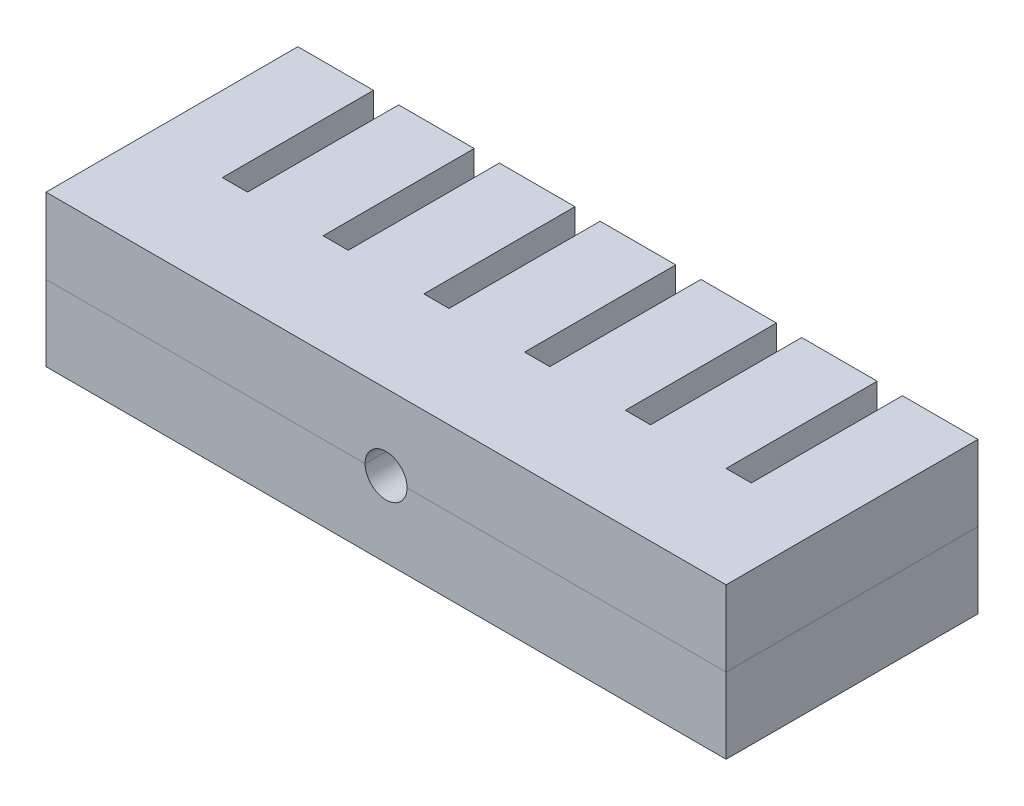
from build123d import *

# Parameters (mm, degrees)
SKETCH1_W                 = 81
SKETCH1_H                 = 30
BOSS_EXTRUDE1_DEPTH       = 9
SKETCH2_W                 = 3
SKETCH2_H                 = 18
SIDE_RELIEF_CUT_DEPTH     = 87.844688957
SKETCH4_W                 = 5
SKETCH4_H                 = 18
CHAMBER_DEPTH             = 6
SIDE_RELIEF_PATTERN_COUNT = 6
SIDE_RELIEF_PATTERN_PITCH = 12
CHAMBER_PATTERN_COUNT     = 7
CHAMBER_PATTERN_PITCH     = 12
SKETCH3_W                 = 77
SKETCH3_H                 = 3
MANIFOLD_DEPTH            = 3
SKETCH5_R                 = 2.5
INPUT_PORT_DEPTH          = 9


with BuildPart() as part:
    # Sketch1 → Boss-Extrude1 (new, symmetric)
    with BuildSketch(Plane(origin=(0, 0, 0), x_dir=(1, 0, 0), z_dir=(0, 1, 0))):
        with Locations((40.5, 15)):
            Rectangle(SKETCH1_W, SKETCH1_H)
    extrude(amount=BOSS_EXTRUDE1_DEPTH, both=True)

    # Sketch2 → side relief cut (cut, symmetric)
    with BuildSketch(Plane(origin=(0, 0, 0), x_dir=(1, 0, 0), z_dir=(0, 1, 0))):
        with Locations((10.5, 21)):
            Rectangle(SKETCH2_W, SKETCH2_H)
    side_relief_cut = extrude(amount=SIDE_RELIEF_CUT_DEPTH, both=True, mode=Mode.SUBTRACT)

    # Sketch4 → chamber (cut, symmetric)
    with BuildSketch(Plane(origin=(0, 0, 0), x_dir=(1, 0, 0), z_dir=(0, 1, 0))):
        with Locations((4.5, 15)):
            Rectangle(SKETCH4_W, SKETCH4_H)
    chamber = extrude(amount=CHAMBER_DEPTH, both=True, mode=Mode.SUBTRACT)

    # side relief pattern: side relief cut ×6
    with Locations(*[(i * SIDE_RELIEF_PATTERN_PITCH, 0, 0) for i in range(1, SIDE_RELIEF_PATTERN_COUNT)]):
        add(side_relief_cut, mode=Mode.SUBTRACT)

    # chamber pattern: chamber ×7
    with Locations(*[(i * CHAMBER_PATTERN_PITCH, 0, 0) for i in range(1, CHAMBER_PATTERN_COUNT)]):
        add(chamber, mode=Mode.SUBTRACT)

    # Sketch3 → manifold (cut, symmetric)
    with BuildSketch(Plane(origin=(0, 0, 0), x_dir=(1, 0, 0), z_dir=(0, 1, 0))):
        with Locations((40.5, 7.5)):
            Rectangle(SKETCH3_W, SKETCH3_H)
    extrude(amount=MANIFOLD_DEPTH, both=True, mode=Mode.SUBTRACT)

    # Sketch5 → input port (cut)
    with BuildSketch(Plane(origin=(0, 0, 0), x_dir=(-1, 0, 0), z_dir=(0, 0, -1))):
        with Locations(Location((-40.5, 0, 0), (0, 0, 180))):
            Circle(SKETCH5_R)
    extrude(amount=INPUT_PORT_DEPTH, mode=Mode.SUBTRACT)


with BuildPart() as body_2:
    # Split1: the piece on the far side of the plane
    add(part.part)
    split(bisect_by=Plane.ZX, keep=Keep.BOTTOM)


with BuildPart() as part_1:
    add(part.part)

    # Split1
    split(bisect_by=Plane.ZX, keep=Keep.TOP)


solid = Compound([body_2.part, part_1.part])
